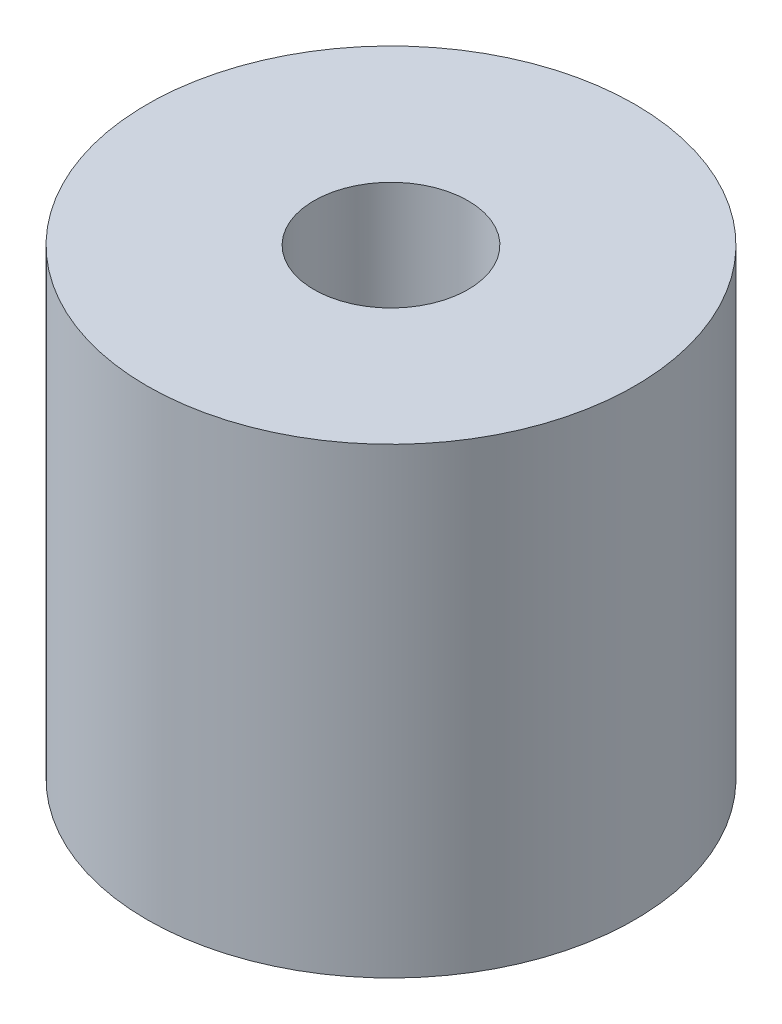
from build123d import *

# Parameters (mm, degrees)
SKETCH1_R               = 9.5
BOSS_EXTRUDE1_DEPTH     = 18
CUT_EXTRUDE1_DEPTH      = 23.461077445
CUT_EXTRUDE1_DEPTH_BACK = 23.461077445
SKETCH2_R               = 3


with BuildPart() as part:
    # Sketch1 → Boss-Extrude1 (new body)
    with BuildSketch(Plane(origin=(0, 0, 0), x_dir=(1, 0, 0), z_dir=(0, 1, 0))):
        with Locations(Location((0, 0, 0), (0, 0, 270))):
            Circle(SKETCH1_R)
    extrude(amount=BOSS_EXTRUDE1_DEPTH)

    # Sketch2 → Cut-Extrude1 (cut, two sides: drawn at the far end of the back side and taken through both)
    with BuildSketch(Plane.XZ.offset(-CUT_EXTRUDE1_DEPTH_BACK)):
        with Locations(Location((0, 0, 0), (0, 0, 270))):
            Circle(SKETCH2_R)
    extrude(amount=CUT_EXTRUDE1_DEPTH + CUT_EXTRUDE1_DEPTH_BACK, mode=Mode.SUBTRACT)


solid = part.part
